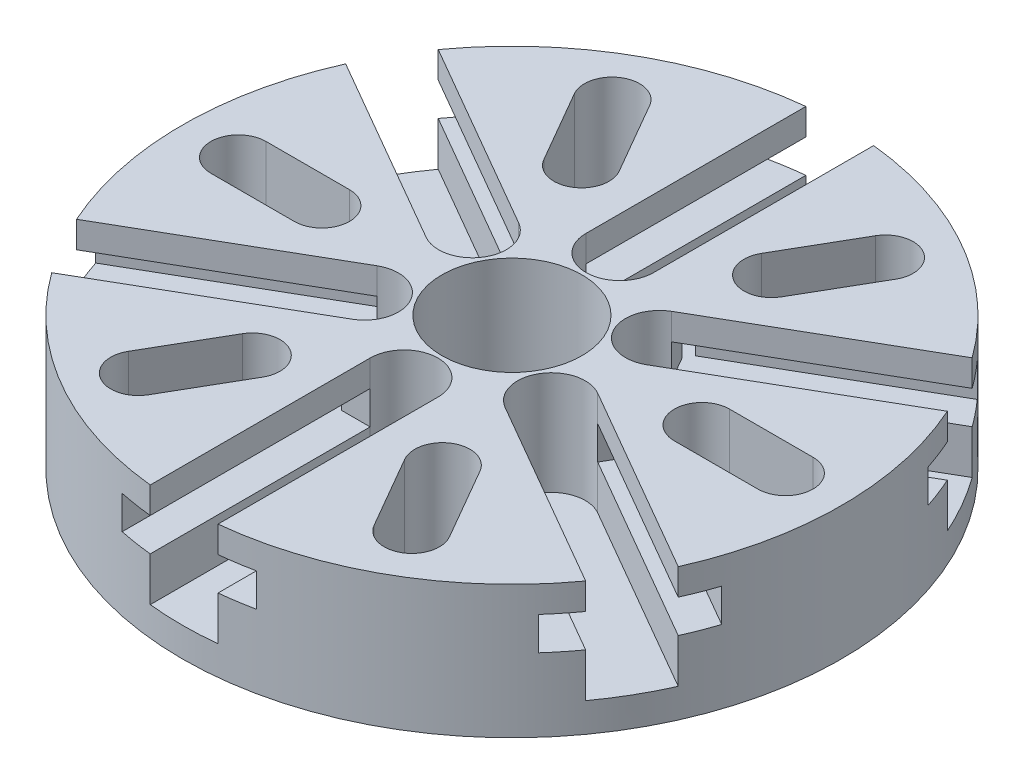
from build123d import *

# Parameters (mm, degrees)
SKETCH1_R           = 31.496
EXTRUDE1_DEPTH      = 12.7
CUT_EXTRUDE1_DEPTH  = 21.1836
CUT_EXTRUDE14_REACH = 48.317
SKETCH10_R          = 3.2385
CUT_EXTRUDE12_DEPTH = 47.31723256
SKETCH8_R           = 6.696722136
CUT_EXTRUDE13_DEPTH = 9.906
CIRPATTERN2_COUNT   = 6


with BuildPart() as part:
    # Sketch1 → Extrude1 (new body)
    with BuildSketch(Plane(origin=(0, 0, 0), x_dir=(1, 0, 0), z_dir=(0, 1, 0))):
        with Locations(Location((0, 0, 0), (0, 0, 270))):
            Circle(SKETCH1_R)
    extrude(amount=EXTRUDE1_DEPTH)

    # Sketch2 → Cut-Extrude1 (cut)
    with BuildSketch(Plane.XY.offset(31.496)):
        Polygon((-3.2385, 12.7), (3.2385, 12.7), (3.2385, 10.1727), (6.4135, 10.1727), (6.4135, 6.9977), (3.2385, 6.9977), (3.2385, 2.794), (-3.2385, 2.794), (-3.2385, 6.9977), (-6.4135, 6.9977), (-6.4135, 10.1727), (-3.2385, 10.1727), align=None)
    cut_extrude1 = extrude(amount=-CUT_EXTRUDE1_DEPTH, mode=Mode.SUBTRACT)

    # Cut-Extrude14: up to this face of the body (flat: up to its plane)
    cut_extrude14_end = Plane(part.part.faces().sort_by_distance((0, 2.794, 20.876465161))[0])
    # Sketch10 → Cut-Extrude14 (cut, up to the picked face)
    with BuildSketch(Plane(origin=(0, 12.7, 0), x_dir=(1, 0, 0), z_dir=(0, 1, 0)), mode=Mode.PRIVATE) as cut_extrude14_sk1:
        with Locations((0, -10.3124)):
            Circle(SKETCH10_R)
    cut_extrude14_tool1 = split(extrude(cut_extrude14_sk1.sketch, amount=-CUT_EXTRUDE14_REACH, mode=Mode.PRIVATE), bisect_by=cut_extrude14_end, keep=Keep.BOTH, mode=Mode.PRIVATE)
    cut_extrude14 = cut_extrude14_tool1.solids().sort_by(Axis((0, 12.7, 10.3124), (0, -1, 0)))[0]
    add(cut_extrude14, mode=Mode.SUBTRACT)

    # Sketch7 → Cut-Extrude12 (cut, through all)
    with BuildSketch(Plane(origin=(0, 12.7, 0), x_dir=(1, 0, 0), z_dir=(0, 1, 0))):
        with BuildLine():
            Line((18.161, -2.63525), (26.1366, -2.63525))
            ThreePointArc((26.1366, -2.63525), (28.77185, 0), (26.1366, 2.63525))
            Line((26.1366, 2.63525), (18.161, 2.63525))
            ThreePointArc((18.161, 2.63525), (15.52575, 0), (18.161, -2.63525))
        make_face()
    cut_extrude12 = extrude(amount=-CUT_EXTRUDE12_DEPTH, mode=Mode.SUBTRACT)

    # Sketch8 → Cut-Extrude13 (cut)
    with BuildSketch(Plane(origin=(0, 12.7, 0), x_dir=(1, 0, 0), z_dir=(0, 1, 0))):
        with Locations(Location((0, 0, 0), (0, 0, 270))):
            Circle(SKETCH8_R)
    extrude(amount=-CUT_EXTRUDE13_DEPTH, mode=Mode.SUBTRACT)

    # CirPattern2: Cut-Extrude1, Cut-Extrude14, Cut-Extrude12 ×6 about axis
    cirpattern2_axis = Axis((0, 0, 0), (0, 1, 0))
    add([cut_extrude1.rotate(cirpattern2_axis, i * 360 / CIRPATTERN2_COUNT) for i in range(1, CIRPATTERN2_COUNT)], mode=Mode.SUBTRACT)
    add([cut_extrude14.rotate(cirpattern2_axis, i * 360 / CIRPATTERN2_COUNT) for i in range(1, CIRPATTERN2_COUNT)], mode=Mode.SUBTRACT)
    add([cut_extrude12.rotate(cirpattern2_axis, i * 360 / CIRPATTERN2_COUNT) for i in range(1, CIRPATTERN2_COUNT)], mode=Mode.SUBTRACT)


solid = part.part
